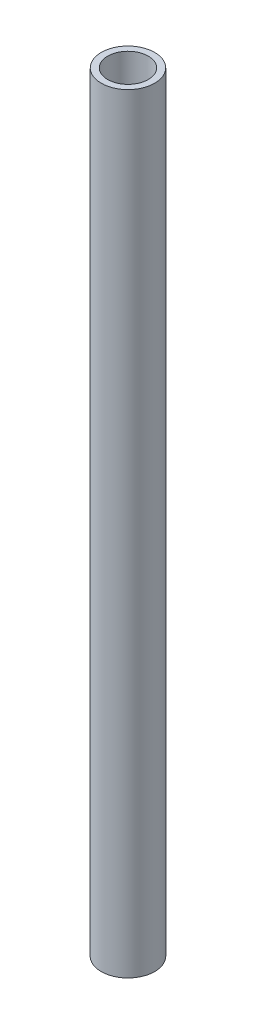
from build123d import *

# Parameters (mm, degrees)
ESQUISSE1_R        = 12.5
ESQUISSE1_R_2      = 9.5
BOSS_EXTRU_1_DEPTH = 360


with BuildPart() as part:
    # Esquisse1 → Boss.-Extru.1 (new body)
    with BuildSketch(Plane(origin=(0, 0, 0), x_dir=(1, 0, 0), z_dir=(0, 1, 0))):
        with Locations(Location((0, 0, 0), (0, 0, 270))):
            Circle(ESQUISSE1_R)
        with Locations(Location((0, 0, 0), (0, 0, 270))):
            Circle(ESQUISSE1_R_2, mode=Mode.SUBTRACT)
    extrude(amount=-BOSS_EXTRU_1_DEPTH)


solid = part.part
